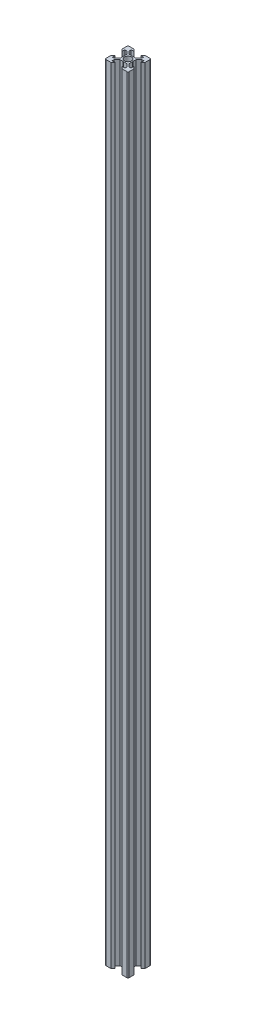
from build123d import *

# Parameters (mm, degrees)
SKETCH1_R           = 3
BOSS_EXTRUDE1_DEPTH = 680


with BuildPart() as part:
    # Sketch1 → Boss-Extrude1 (new body)
    with BuildSketch(Plane(origin=(0, 0, 0), x_dir=(1, 0, 0), z_dir=(0, 1, 0))):
        with BuildLine():
            Line((9.9996, -8.99964), (9.9996, -4.799808))
            Line((9.9996, -4.799808), (8.199672, -2.99988))
            Line((8.199672, -2.99988), (8.199672, -5.49978))
            Line((8.199672, -5.49978), (6.560397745, -5.49978))
            Line((6.560397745, -5.49978), (3.99984, -2.939222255))
            Line((3.99984, -2.939222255), (3.99984, -0.299988))
            Line((3.99984, -0.299988), (3.699852, 0))
            Line((3.699852, 0), (3.99984, 0.299988))
            Line((3.99984, 0.299988), (3.99984, 2.939222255))
            Line((3.99984, 2.939222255), (6.560397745, 5.49978))
            Line((6.560397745, 5.49978), (8.199672, 5.49978))
            Line((8.199672, 5.49978), (8.199672, 2.99988))
            Line((8.199672, 2.99988), (9.9996, 4.799808))
            Line((9.9996, 4.799808), (9.9996, 8.99964))
            ThreePointArc((9.9996, 8.99964), (9.706718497, 9.706718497), (8.99964, 9.9996))
            Line((8.99964, 9.9996), (4.799808, 9.9996))
            Line((4.799808, 9.9996), (2.99988, 8.199672))
            Line((2.99988, 8.199672), (5.49978, 8.199672))
            Line((5.49978, 8.199672), (5.49978, 6.560397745))
            Line((5.49978, 6.560397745), (2.939222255, 3.99984))
            Line((2.939222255, 3.99984), (0.299988, 3.99984))
            Line((0.299988, 3.99984), (0, 3.699852))
            Line((0, 3.699852), (-0.299988, 3.99984))
            Line((-0.299988, 3.99984), (-2.939222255, 3.99984))
            Line((-2.939222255, 3.99984), (-5.49978, 6.560397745))
            Line((-5.49978, 6.560397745), (-5.49978, 8.199672))
            Line((-5.49978, 8.199672), (-2.99988, 8.199672))
            Line((-2.99988, 8.199672), (-4.799808, 9.9996))
            Line((-4.799808, 9.9996), (-8.99964, 9.9996))
            ThreePointArc((-8.99964, 9.9996), (-9.706718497, 9.706718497), (-9.9996, 8.99964))
            Line((-9.9996, 8.99964), (-9.9996, 4.799808))
            Line((-9.9996, 4.799808), (-8.199672, 2.99988))
            Line((-8.199672, 2.99988), (-8.199672, 5.49978))
            Line((-8.199672, 5.49978), (-6.560397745, 5.49978))
            Line((-6.560397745, 5.49978), (-3.99984, 2.939222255))
            Line((-3.99984, 2.939222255), (-3.99984, 0.299988))
            Line((-3.99984, 0.299988), (-3.699852, 0))
            Line((-3.699852, 0), (-3.99984, -0.299988))
            Line((-3.99984, -0.299988), (-3.99984, -2.939222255))
            Line((-3.99984, -2.939222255), (-6.560397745, -5.49978))
            Line((-6.560397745, -5.49978), (-8.199672, -5.49978))
            Line((-8.199672, -5.49978), (-8.199672, -2.99988))
            Line((-8.199672, -2.99988), (-9.9996, -4.799808))
            Line((-9.9996, -4.799808), (-9.9996, -8.99964))
            ThreePointArc((-9.9996, -8.99964), (-9.706718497, -9.706718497), (-8.99964, -9.9996))
            Line((-8.99964, -9.9996), (-4.799808, -9.9996))
            Line((-4.799808, -9.9996), (-2.99988, -8.199672))
            Line((-2.99988, -8.199672), (-5.49978, -8.199672))
            Line((-5.49978, -8.199672), (-5.49978, -6.560397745))
            Line((-5.49978, -6.560397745), (-2.939222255, -3.99984))
            Line((-2.939222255, -3.99984), (-0.299988, -3.99984))
            Line((-0.299988, -3.99984), (0, -3.699852))
            Line((0, -3.699852), (0.299988, -3.99984))
            Line((0.299988, -3.99984), (2.939222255, -3.99984))
            Line((2.939222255, -3.99984), (5.49978, -6.560397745))
            Line((5.49978, -6.560397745), (5.49978, -8.199672))
            Line((5.49978, -8.199672), (2.99988, -8.199672))
            Line((2.99988, -8.199672), (4.799808, -9.9996))
            Line((4.799808, -9.9996), (8.99964, -9.9996))
            ThreePointArc((8.99964, -9.9996), (9.706718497, -9.706718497), (9.9996, -8.99964))
        make_face()
        with Locations(Location((0, 0, 0), (0, 0, 270))):
            Circle(SKETCH1_R, mode=Mode.SUBTRACT)
    extrude(amount=BOSS_EXTRUDE1_DEPTH)


solid = part.part
